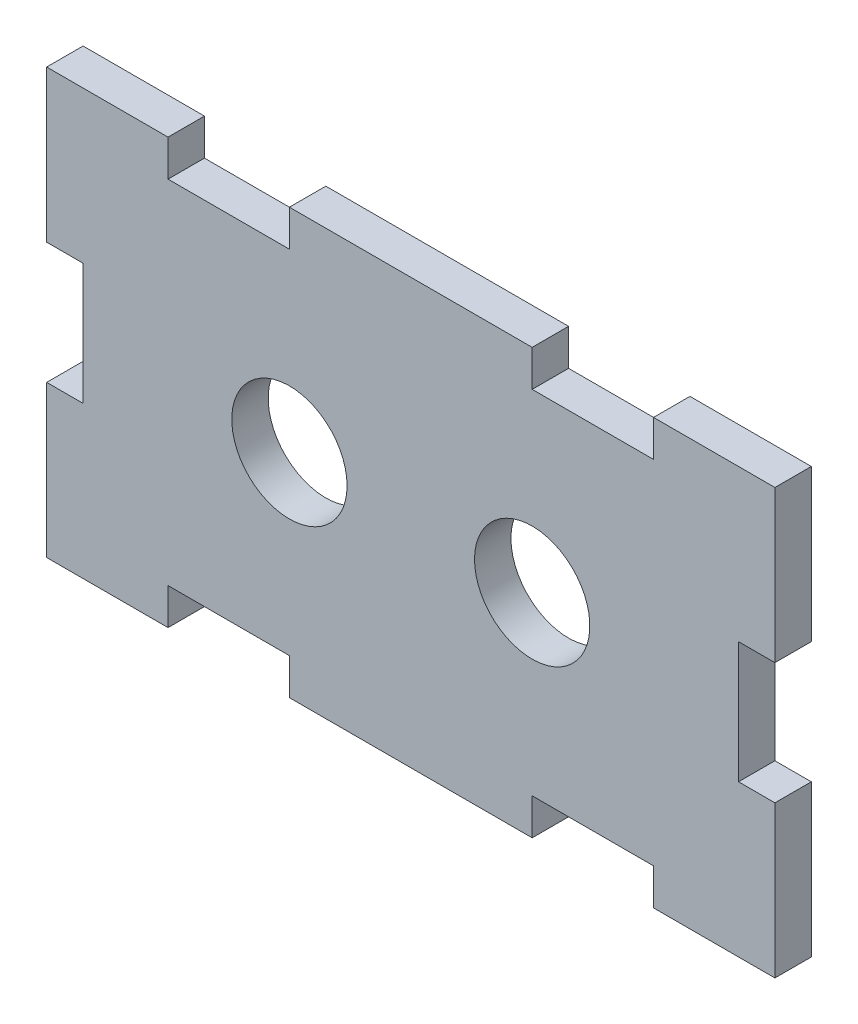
ISO-10303-21;
HEADER;
FILE_DESCRIPTION(('STEP AP214'),'2;1');
FILE_NAME('part.step','',(''),(''),'','','');
FILE_SCHEMA(('AUTOMOTIVE_DESIGN { 1 0 10303 214 1 1 1 1 }'));
ENDSEC;
DATA;
#1=APPLICATION_CONTEXT('core data for automotive mechanical design processes');
#2=APPLICATION_PROTOCOL_DEFINITION('international standard','automotive_design',2000,#1);
#3=PRODUCT_CONTEXT('',#1,'mechanical');
#4=PRODUCT('Part','Part','',(#3));
#5=PRODUCT_RELATED_PRODUCT_CATEGORY('part','',(#4));
#6=PRODUCT_DEFINITION_FORMATION('','',#4);
#7=PRODUCT_DEFINITION_CONTEXT('part definition',#1,'design');
#8=PRODUCT_DEFINITION('design','',#6,#7);
#9=PRODUCT_DEFINITION_SHAPE('','',#8);
#10=(LENGTH_UNIT() NAMED_UNIT(*) SI_UNIT(.MILLI.,.METRE.));
#11=(NAMED_UNIT(*) PLANE_ANGLE_UNIT() SI_UNIT($,.RADIAN.));
#12=(NAMED_UNIT(*) SI_UNIT($,.STERADIAN.) SOLID_ANGLE_UNIT());
#13=UNCERTAINTY_MEASURE_WITH_UNIT(LENGTH_MEASURE(1.E-05),#10,'distance_accuracy_value','');
#14=(GEOMETRIC_REPRESENTATION_CONTEXT(3) GLOBAL_UNCERTAINTY_ASSIGNED_CONTEXT((#13)) GLOBAL_UNIT_ASSIGNED_CONTEXT((#10,
#11,#12)) REPRESENTATION_CONTEXT('',''));
#15=CARTESIAN_POINT('',(0.,0.,0.));
#16=DIRECTION('',(0.,0.,1.));
#17=DIRECTION('',(1.,0.,0.));
#18=AXIS2_PLACEMENT_3D('',#15,#16,#17);
#19=CARTESIAN_POINT('',(0.,0.,3.));
#20=DIRECTION('',(0.,0.,-1.));
#21=DIRECTION('',(-1.,0.,0.));
#22=AXIS2_PLACEMENT_3D('',#19,#20,#21);
#23=PLANE('',#22);
#24=CARTESIAN_POINT('',(10.,0.,3.));
#25=DIRECTION('',(0.,0.,1.));
#26=DIRECTION('',(-1.,0.,0.));
#27=AXIS2_PLACEMENT_3D('',#24,#25,#26);
#28=CIRCLE('',#27,4.75);
#29=CARTESIAN_POINT('',(5.25,0.,3.));
#30=VERTEX_POINT('',#29);
#31=EDGE_CURVE('E381',#30,#30,#28,.T.);
#32=ORIENTED_EDGE('',*,*,#31,.F.);
#33=EDGE_LOOP('',(#32));
#34=FACE_BOUND('',#33,.T.);
#35=CARTESIAN_POINT('',(-10.,0.,3.));
#36=DIRECTION('',(0.,0.,1.));
#37=DIRECTION('',(1.,0.,0.));
#38=AXIS2_PLACEMENT_3D('',#35,#36,#37);
#39=CIRCLE('',#38,4.75);
#40=CARTESIAN_POINT('',(-5.25,0.,3.));
#41=VERTEX_POINT('',#40);
#42=EDGE_CURVE('E387',#41,#41,#39,.T.);
#43=ORIENTED_EDGE('',*,*,#42,.F.);
#44=EDGE_LOOP('',(#43));
#45=FACE_BOUND('',#44,.T.);
#46=DIRECTION('',(-1.,0.,0.));
#47=VECTOR('',#46,1.);
#48=CARTESIAN_POINT('',(30.,-5.,3.));
#49=LINE('',#48,#47);
#50=CARTESIAN_POINT('',(30.,-5.,3.));
#51=VERTEX_POINT('',#50);
#52=CARTESIAN_POINT('',(27.,-5.,3.));
#53=VERTEX_POINT('',#52);
#54=EDGE_CURVE('E249',#51,#53,#49,.T.);
#55=ORIENTED_EDGE('',*,*,#54,.T.);
#56=DIRECTION('',(0.,1.,0.));
#57=VECTOR('',#56,1.);
#58=CARTESIAN_POINT('',(27.,5.,3.));
#59=LINE('',#58,#57);
#60=CARTESIAN_POINT('',(27.,5.,3.));
#61=VERTEX_POINT('',#60);
#62=EDGE_CURVE('E226',#53,#61,#59,.T.);
#63=ORIENTED_EDGE('',*,*,#62,.T.);
#64=DIRECTION('',(1.,0.,0.));
#65=VECTOR('',#64,1.);
#66=CARTESIAN_POINT('',(30.,5.,3.));
#67=LINE('',#66,#65);
#68=CARTESIAN_POINT('',(30.,5.,3.));
#69=VERTEX_POINT('',#68);
#70=EDGE_CURVE('E222',#61,#69,#67,.T.);
#71=ORIENTED_EDGE('',*,*,#70,.T.);
#72=DIRECTION('',(0.,1.,0.));
#73=VECTOR('',#72,1.);
#74=CARTESIAN_POINT('',(30.,-17.5,3.));
#75=LINE('',#74,#73);
#76=CARTESIAN_POINT('',(30.,17.5,3.));
#77=VERTEX_POINT('',#76);
#78=EDGE_CURVE('E401',#69,#77,#75,.T.);
#79=ORIENTED_EDGE('',*,*,#78,.T.);
#80=DIRECTION('',(-1.,0.,0.));
#81=VECTOR('',#80,1.);
#82=CARTESIAN_POINT('',(-30.,17.5,3.));
#83=LINE('',#82,#81);
#84=CARTESIAN_POINT('',(20.,17.5,3.));
#85=VERTEX_POINT('',#84);
#86=EDGE_CURVE('E407',#77,#85,#83,.T.);
#87=ORIENTED_EDGE('',*,*,#86,.T.);
#88=DIRECTION('',(0.,-1.,0.));
#89=VECTOR('',#88,1.);
#90=CARTESIAN_POINT('',(20.,17.5,3.));
#91=LINE('',#90,#89);
#92=CARTESIAN_POINT('',(20.,14.5,3.));
#93=VERTEX_POINT('',#92);
#94=EDGE_CURVE('E338',#85,#93,#91,.T.);
#95=ORIENTED_EDGE('',*,*,#94,.T.);
#96=DIRECTION('',(-1.,0.,0.));
#97=VECTOR('',#96,1.);
#98=CARTESIAN_POINT('',(20.,14.5,3.));
#99=LINE('',#98,#97);
#100=CARTESIAN_POINT('',(10.,14.5,3.));
#101=VERTEX_POINT('',#100);
#102=EDGE_CURVE('E329',#93,#101,#99,.T.);
#103=ORIENTED_EDGE('',*,*,#102,.T.);
#104=DIRECTION('',(0.,1.,0.));
#105=VECTOR('',#104,1.);
#106=CARTESIAN_POINT('',(10.,17.5,3.));
#107=LINE('',#106,#105);
#108=CARTESIAN_POINT('',(10.,17.5,3.));
#109=VERTEX_POINT('',#108);
#110=EDGE_CURVE('E334',#101,#109,#107,.T.);
#111=ORIENTED_EDGE('',*,*,#110,.T.);
#112=CARTESIAN_POINT('',(-10.,17.5,3.));
#113=VERTEX_POINT('',#112);
#114=EDGE_CURVE('E411',#109,#113,#83,.T.);
#115=ORIENTED_EDGE('',*,*,#114,.T.);
#116=DIRECTION('',(0.,1.,0.));
#117=VECTOR('',#116,1.);
#118=CARTESIAN_POINT('',(-10.,17.5,3.));
#119=LINE('',#118,#117);
#120=CARTESIAN_POINT('',(-10.,14.5,3.));
#121=VERTEX_POINT('',#120);
#122=EDGE_CURVE('E354',#121,#113,#119,.T.);
#123=ORIENTED_EDGE('',*,*,#122,.F.);
#124=DIRECTION('',(1.,0.,0.));
#125=VECTOR('',#124,1.);
#126=CARTESIAN_POINT('',(-20.,14.5,3.));
#127=LINE('',#126,#125);
#128=CARTESIAN_POINT('',(-20.,14.5,3.));
#129=VERTEX_POINT('',#128);
#130=EDGE_CURVE('E358',#129,#121,#127,.T.);
#131=ORIENTED_EDGE('',*,*,#130,.F.);
#132=DIRECTION('',(0.,-1.,0.));
#133=VECTOR('',#132,1.);
#134=CARTESIAN_POINT('',(-20.,17.5,3.));
#135=LINE('',#134,#133);
#136=CARTESIAN_POINT('',(-20.,17.5,3.));
#137=VERTEX_POINT('',#136);
#138=EDGE_CURVE('E343',#137,#129,#135,.T.);
#139=ORIENTED_EDGE('',*,*,#138,.F.);
#140=CARTESIAN_POINT('',(-30.,17.5,3.));
#141=VERTEX_POINT('',#140);
#142=EDGE_CURVE('E406',#137,#141,#83,.T.);
#143=ORIENTED_EDGE('',*,*,#142,.T.);
#144=DIRECTION('',(0.,-1.,0.));
#145=VECTOR('',#144,1.);
#146=CARTESIAN_POINT('',(-30.,-17.5,3.));
#147=LINE('',#146,#145);
#148=CARTESIAN_POINT('',(-30.,5.,3.));
#149=VERTEX_POINT('',#148);
#150=EDGE_CURVE('E393',#141,#149,#147,.T.);
#151=ORIENTED_EDGE('',*,*,#150,.T.);
#152=DIRECTION('',(-1.,0.,0.));
#153=VECTOR('',#152,1.);
#154=CARTESIAN_POINT('',(-30.,5.,3.));
#155=LINE('',#154,#153);
#156=CARTESIAN_POINT('',(-27.,5.,3.));
#157=VERTEX_POINT('',#156);
#158=EDGE_CURVE('E58',#157,#149,#155,.T.);
#159=ORIENTED_EDGE('',*,*,#158,.F.);
#160=DIRECTION('',(0.,1.,0.));
#161=VECTOR('',#160,1.);
#162=CARTESIAN_POINT('',(-27.,5.,3.));
#163=LINE('',#162,#161);
#164=CARTESIAN_POINT('',(-27.,-5.,3.));
#165=VERTEX_POINT('',#164);
#166=EDGE_CURVE('E255',#165,#157,#163,.T.);
#167=ORIENTED_EDGE('',*,*,#166,.F.);
#168=DIRECTION('',(1.,0.,0.));
#169=VECTOR('',#168,1.);
#170=CARTESIAN_POINT('',(-30.,-5.,3.));
#171=LINE('',#170,#169);
#172=CARTESIAN_POINT('',(-30.,-5.,3.));
#173=VERTEX_POINT('',#172);
#174=EDGE_CURVE('E235',#173,#165,#171,.T.);
#175=ORIENTED_EDGE('',*,*,#174,.F.);
#176=CARTESIAN_POINT('',(-30.,-17.5,3.));
#177=VERTEX_POINT('',#176);
#178=EDGE_CURVE('E397',#173,#177,#147,.T.);
#179=ORIENTED_EDGE('',*,*,#178,.T.);
#180=DIRECTION('',(1.,0.,0.));
#181=VECTOR('',#180,1.);
#182=CARTESIAN_POINT('',(-30.,-17.5,3.));
#183=LINE('',#182,#181);
#184=CARTESIAN_POINT('',(-20.,-17.5,3.));
#185=VERTEX_POINT('',#184);
#186=EDGE_CURVE('E398',#177,#185,#183,.T.);
#187=ORIENTED_EDGE('',*,*,#186,.T.);
#188=DIRECTION('',(0.,1.,0.));
#189=VECTOR('',#188,1.);
#190=CARTESIAN_POINT('',(-20.,-17.5,3.));
#191=LINE('',#190,#189);
#192=CARTESIAN_POINT('',(-20.,-14.5,3.));
#193=VERTEX_POINT('',#192);
#194=EDGE_CURVE('E286',#185,#193,#191,.T.);
#195=ORIENTED_EDGE('',*,*,#194,.T.);
#196=DIRECTION('',(1.,0.,0.));
#197=VECTOR('',#196,1.);
#198=CARTESIAN_POINT('',(-20.,-14.5,3.));
#199=LINE('',#198,#197);
#200=CARTESIAN_POINT('',(-10.,-14.5,3.));
#201=VERTEX_POINT('',#200);
#202=EDGE_CURVE('E277',#193,#201,#199,.T.);
#203=ORIENTED_EDGE('',*,*,#202,.T.);
#204=DIRECTION('',(0.,-1.,0.));
#205=VECTOR('',#204,1.);
#206=CARTESIAN_POINT('',(-10.,-17.5,3.));
#207=LINE('',#206,#205);
#208=CARTESIAN_POINT('',(-10.,-17.5,3.));
#209=VERTEX_POINT('',#208);
#210=EDGE_CURVE('E282',#201,#209,#207,.T.);
#211=ORIENTED_EDGE('',*,*,#210,.T.);
#212=CARTESIAN_POINT('',(10.,-17.5,3.));
#213=VERTEX_POINT('',#212);
#214=EDGE_CURVE('E402',#209,#213,#183,.T.);
#215=ORIENTED_EDGE('',*,*,#214,.T.);
#216=DIRECTION('',(0.,-1.,0.));
#217=VECTOR('',#216,1.);
#218=CARTESIAN_POINT('',(10.,-17.5,3.));
#219=LINE('',#218,#217);
#220=CARTESIAN_POINT('',(10.,-14.5,3.));
#221=VERTEX_POINT('',#220);
#222=EDGE_CURVE('E302',#221,#213,#219,.T.);
#223=ORIENTED_EDGE('',*,*,#222,.F.);
#224=DIRECTION('',(-1.,0.,0.));
#225=VECTOR('',#224,1.);
#226=CARTESIAN_POINT('',(20.,-14.5,3.));
#227=LINE('',#226,#225);
#228=CARTESIAN_POINT('',(20.,-14.5,3.));
#229=VERTEX_POINT('',#228);
#230=EDGE_CURVE('E306',#229,#221,#227,.T.);
#231=ORIENTED_EDGE('',*,*,#230,.F.);
#232=DIRECTION('',(0.,1.,0.));
#233=VECTOR('',#232,1.);
#234=CARTESIAN_POINT('',(20.,-17.5,3.));
#235=LINE('',#234,#233);
#236=CARTESIAN_POINT('',(20.,-17.5,3.));
#237=VERTEX_POINT('',#236);
#238=EDGE_CURVE('E291',#237,#229,#235,.T.);
#239=ORIENTED_EDGE('',*,*,#238,.F.);
#240=CARTESIAN_POINT('',(30.,-17.5,3.));
#241=VERTEX_POINT('',#240);
#242=EDGE_CURVE('E396',#237,#241,#183,.T.);
#243=ORIENTED_EDGE('',*,*,#242,.T.);
#244=EDGE_CURVE('E403',#241,#51,#75,.T.);
#245=ORIENTED_EDGE('',*,*,#244,.T.);
#246=EDGE_LOOP('',(#55,#63,#71,#79,#87,#95,#103,#111,#115,#123,#131,#139,#143,#151,#159,#167,
#175,#179,#187,#195,#203,#211,#215,#223,#231,#239,#243,#245));
#247=FACE_BOUND('',#246,.T.);
#248=ADVANCED_FACE('F35',(#34,#45,#247),#23,.F.);
#249=CARTESIAN_POINT('',(0.,0.,0.));
#250=DIRECTION('',(0.,0.,-1.));
#251=DIRECTION('',(-1.,0.,0.));
#252=AXIS2_PLACEMENT_3D('',#249,#250,#251);
#253=PLANE('',#252);
#254=CARTESIAN_POINT('',(-10.,0.,0.));
#255=DIRECTION('',(0.,0.,1.));
#256=DIRECTION('',(1.,0.,0.));
#257=AXIS2_PLACEMENT_3D('',#254,#255,#256);
#258=CIRCLE('',#257,4.75);
#259=CARTESIAN_POINT('',(-5.25,0.,0.));
#260=VERTEX_POINT('',#259);
#261=EDGE_CURVE('E384',#260,#260,#258,.T.);
#262=ORIENTED_EDGE('',*,*,#261,.T.);
#263=EDGE_LOOP('',(#262));
#264=FACE_BOUND('',#263,.T.);
#265=CARTESIAN_POINT('',(10.,0.,0.));
#266=DIRECTION('',(0.,0.,1.));
#267=DIRECTION('',(-1.,0.,0.));
#268=AXIS2_PLACEMENT_3D('',#265,#266,#267);
#269=CIRCLE('',#268,4.75);
#270=CARTESIAN_POINT('',(5.25,0.,0.));
#271=VERTEX_POINT('',#270);
#272=EDGE_CURVE('E380',#271,#271,#269,.T.);
#273=ORIENTED_EDGE('',*,*,#272,.T.);
#274=EDGE_LOOP('',(#273));
#275=FACE_BOUND('',#274,.T.);
#276=DIRECTION('',(0.,1.,0.));
#277=VECTOR('',#276,1.);
#278=CARTESIAN_POINT('',(27.,5.,0.));
#279=LINE('',#278,#277);
#280=CARTESIAN_POINT('',(27.,-5.,0.));
#281=VERTEX_POINT('',#280);
#282=CARTESIAN_POINT('',(27.,5.,0.));
#283=VERTEX_POINT('',#282);
#284=EDGE_CURVE('E229',#281,#283,#279,.T.);
#285=ORIENTED_EDGE('',*,*,#284,.F.);
#286=DIRECTION('',(-1.,0.,0.));
#287=VECTOR('',#286,1.);
#288=CARTESIAN_POINT('',(30.,-5.,0.));
#289=LINE('',#288,#287);
#290=CARTESIAN_POINT('',(30.,-5.,0.));
#291=VERTEX_POINT('',#290);
#292=EDGE_CURVE('E236',#291,#281,#289,.T.);
#293=ORIENTED_EDGE('',*,*,#292,.F.);
#294=DIRECTION('',(0.,1.,0.));
#295=VECTOR('',#294,1.);
#296=CARTESIAN_POINT('',(30.,-17.5,0.));
#297=LINE('',#296,#295);
#298=CARTESIAN_POINT('',(30.,-17.5,0.));
#299=VERTEX_POINT('',#298);
#300=EDGE_CURVE('E420',#299,#291,#297,.T.);
#301=ORIENTED_EDGE('',*,*,#300,.F.);
#302=DIRECTION('',(1.,0.,0.));
#303=VECTOR('',#302,1.);
#304=CARTESIAN_POINT('',(-30.,-17.5,0.));
#305=LINE('',#304,#303);
#306=CARTESIAN_POINT('',(20.,-17.5,0.));
#307=VERTEX_POINT('',#306);
#308=EDGE_CURVE('E415',#307,#299,#305,.T.);
#309=ORIENTED_EDGE('',*,*,#308,.F.);
#310=DIRECTION('',(0.,1.,0.));
#311=VECTOR('',#310,1.);
#312=CARTESIAN_POINT('',(20.,-17.5,0.));
#313=LINE('',#312,#311);
#314=CARTESIAN_POINT('',(20.,-14.5,0.));
#315=VERTEX_POINT('',#314);
#316=EDGE_CURVE('E314',#307,#315,#313,.T.);
#317=ORIENTED_EDGE('',*,*,#316,.T.);
#318=DIRECTION('',(-1.,0.,0.));
#319=VECTOR('',#318,1.);
#320=CARTESIAN_POINT('',(20.,-14.5,0.));
#321=LINE('',#320,#319);
#322=CARTESIAN_POINT('',(10.,-14.5,0.));
#323=VERTEX_POINT('',#322);
#324=EDGE_CURVE('E305',#315,#323,#321,.T.);
#325=ORIENTED_EDGE('',*,*,#324,.T.);
#326=DIRECTION('',(0.,-1.,0.));
#327=VECTOR('',#326,1.);
#328=CARTESIAN_POINT('',(10.,-17.5,0.));
#329=LINE('',#328,#327);
#330=CARTESIAN_POINT('',(10.,-17.5,0.));
#331=VERTEX_POINT('',#330);
#332=EDGE_CURVE('E319',#323,#331,#329,.T.);
#333=ORIENTED_EDGE('',*,*,#332,.T.);
#334=CARTESIAN_POINT('',(-10.,-17.5,0.));
#335=VERTEX_POINT('',#334);
#336=EDGE_CURVE('E419',#335,#331,#305,.T.);
#337=ORIENTED_EDGE('',*,*,#336,.F.);
#338=DIRECTION('',(0.,-1.,0.));
#339=VECTOR('',#338,1.);
#340=CARTESIAN_POINT('',(-10.,-17.5,0.));
#341=LINE('',#340,#339);
#342=CARTESIAN_POINT('',(-10.,-14.5,0.));
#343=VERTEX_POINT('',#342);
#344=EDGE_CURVE('E289',#343,#335,#341,.T.);
#345=ORIENTED_EDGE('',*,*,#344,.F.);
#346=DIRECTION('',(1.,0.,0.));
#347=VECTOR('',#346,1.);
#348=CARTESIAN_POINT('',(-20.,-14.5,0.));
#349=LINE('',#348,#347);
#350=CARTESIAN_POINT('',(-20.,-14.5,0.));
#351=VERTEX_POINT('',#350);
#352=EDGE_CURVE('E292',#351,#343,#349,.T.);
#353=ORIENTED_EDGE('',*,*,#352,.F.);
#354=DIRECTION('',(0.,1.,0.));
#355=VECTOR('',#354,1.);
#356=CARTESIAN_POINT('',(-20.,-17.5,0.));
#357=LINE('',#356,#355);
#358=CARTESIAN_POINT('',(-20.,-17.5,0.));
#359=VERTEX_POINT('',#358);
#360=EDGE_CURVE('E294',#359,#351,#357,.T.);
#361=ORIENTED_EDGE('',*,*,#360,.F.);
#362=CARTESIAN_POINT('',(-30.,-17.5,0.));
#363=VERTEX_POINT('',#362);
#364=EDGE_CURVE('E416',#363,#359,#305,.T.);
#365=ORIENTED_EDGE('',*,*,#364,.F.);
#366=DIRECTION('',(0.,-1.,0.));
#367=VECTOR('',#366,1.);
#368=CARTESIAN_POINT('',(-30.,-17.5,0.));
#369=LINE('',#368,#367);
#370=CARTESIAN_POINT('',(-30.,-5.,0.));
#371=VERTEX_POINT('',#370);
#372=EDGE_CURVE('E390',#371,#363,#369,.T.);
#373=ORIENTED_EDGE('',*,*,#372,.F.);
#374=DIRECTION('',(1.,0.,0.));
#375=VECTOR('',#374,1.);
#376=CARTESIAN_POINT('',(-30.,-5.,0.));
#377=LINE('',#376,#375);
#378=CARTESIAN_POINT('',(-27.,-5.,0.));
#379=VERTEX_POINT('',#378);
#380=EDGE_CURVE('E254',#371,#379,#377,.T.);
#381=ORIENTED_EDGE('',*,*,#380,.T.);
#382=DIRECTION('',(0.,1.,0.));
#383=VECTOR('',#382,1.);
#384=CARTESIAN_POINT('',(-27.,5.,0.));
#385=LINE('',#384,#383);
#386=CARTESIAN_POINT('',(-27.,5.,0.));
#387=VERTEX_POINT('',#386);
#388=EDGE_CURVE('E268',#379,#387,#385,.T.);
#389=ORIENTED_EDGE('',*,*,#388,.T.);
#390=DIRECTION('',(-1.,0.,0.));
#391=VECTOR('',#390,1.);
#392=CARTESIAN_POINT('',(-30.,5.,0.));
#393=LINE('',#392,#391);
#394=CARTESIAN_POINT('',(-30.,5.,0.));
#395=VERTEX_POINT('',#394);
#396=EDGE_CURVE('E263',#387,#395,#393,.T.);
#397=ORIENTED_EDGE('',*,*,#396,.T.);
#398=CARTESIAN_POINT('',(-30.,17.5,0.));
#399=VERTEX_POINT('',#398);
#400=EDGE_CURVE('E412',#399,#395,#369,.T.);
#401=ORIENTED_EDGE('',*,*,#400,.F.);
#402=DIRECTION('',(-1.,0.,0.));
#403=VECTOR('',#402,1.);
#404=CARTESIAN_POINT('',(-30.,17.5,0.));
#405=LINE('',#404,#403);
#406=CARTESIAN_POINT('',(-20.,17.5,0.));
#407=VERTEX_POINT('',#406);
#408=EDGE_CURVE('E423',#407,#399,#405,.T.);
#409=ORIENTED_EDGE('',*,*,#408,.F.);
#410=DIRECTION('',(0.,-1.,0.));
#411=VECTOR('',#410,1.);
#412=CARTESIAN_POINT('',(-20.,17.5,0.));
#413=LINE('',#412,#411);
#414=CARTESIAN_POINT('',(-20.,14.5,0.));
#415=VERTEX_POINT('',#414);
#416=EDGE_CURVE('E366',#407,#415,#413,.T.);
#417=ORIENTED_EDGE('',*,*,#416,.T.);
#418=DIRECTION('',(1.,0.,0.));
#419=VECTOR('',#418,1.);
#420=CARTESIAN_POINT('',(-20.,14.5,0.));
#421=LINE('',#420,#419);
#422=CARTESIAN_POINT('',(-10.,14.5,0.));
#423=VERTEX_POINT('',#422);
#424=EDGE_CURVE('E357',#415,#423,#421,.T.);
#425=ORIENTED_EDGE('',*,*,#424,.T.);
#426=DIRECTION('',(0.,1.,0.));
#427=VECTOR('',#426,1.);
#428=CARTESIAN_POINT('',(-10.,17.5,0.));
#429=LINE('',#428,#427);
#430=CARTESIAN_POINT('',(-10.,17.5,0.));
#431=VERTEX_POINT('',#430);
#432=EDGE_CURVE('E371',#423,#431,#429,.T.);
#433=ORIENTED_EDGE('',*,*,#432,.T.);
#434=CARTESIAN_POINT('',(10.,17.5,0.));
#435=VERTEX_POINT('',#434);
#436=EDGE_CURVE('E427',#435,#431,#405,.T.);
#437=ORIENTED_EDGE('',*,*,#436,.F.);
#438=DIRECTION('',(0.,1.,0.));
#439=VECTOR('',#438,1.);
#440=CARTESIAN_POINT('',(10.,17.5,0.));
#441=LINE('',#440,#439);
#442=CARTESIAN_POINT('',(10.,14.5,0.));
#443=VERTEX_POINT('',#442);
#444=EDGE_CURVE('E341',#443,#435,#441,.T.);
#445=ORIENTED_EDGE('',*,*,#444,.F.);
#446=DIRECTION('',(-1.,0.,0.));
#447=VECTOR('',#446,1.);
#448=CARTESIAN_POINT('',(20.,14.5,0.));
#449=LINE('',#448,#447);
#450=CARTESIAN_POINT('',(20.,14.5,0.));
#451=VERTEX_POINT('',#450);
#452=EDGE_CURVE('E344',#451,#443,#449,.T.);
#453=ORIENTED_EDGE('',*,*,#452,.F.);
#454=DIRECTION('',(0.,-1.,0.));
#455=VECTOR('',#454,1.);
#456=CARTESIAN_POINT('',(20.,17.5,0.));
#457=LINE('',#456,#455);
#458=CARTESIAN_POINT('',(20.,17.5,0.));
#459=VERTEX_POINT('',#458);
#460=EDGE_CURVE('E346',#459,#451,#457,.T.);
#461=ORIENTED_EDGE('',*,*,#460,.F.);
#462=CARTESIAN_POINT('',(30.,17.5,0.));
#463=VERTEX_POINT('',#462);
#464=EDGE_CURVE('E424',#463,#459,#405,.T.);
#465=ORIENTED_EDGE('',*,*,#464,.F.);
#466=CARTESIAN_POINT('',(30.,5.,0.));
#467=VERTEX_POINT('',#466);
#468=EDGE_CURVE('E241',#467,#463,#297,.T.);
#469=ORIENTED_EDGE('',*,*,#468,.F.);
#470=DIRECTION('',(1.,0.,0.));
#471=VECTOR('',#470,1.);
#472=CARTESIAN_POINT('',(30.,5.,0.));
#473=LINE('',#472,#471);
#474=EDGE_CURVE('E50',#283,#467,#473,.T.);
#475=ORIENTED_EDGE('',*,*,#474,.F.);
#476=EDGE_LOOP('',(#285,#293,#301,#309,#317,#325,#333,#337,#345,#353,#361,#365,#373,#381,#389,
#397,#401,#409,#417,#425,#433,#437,#445,#453,#461,#465,#469,#475));
#477=FACE_BOUND('',#476,.T.);
#478=ADVANCED_FACE('F239',(#264,#275,#477),#253,.T.);
#479=CARTESIAN_POINT('',(30.,-17.5,3.));
#480=DIRECTION('',(-1.,0.,0.));
#481=DIRECTION('',(0.,0.,1.));
#482=AXIS2_PLACEMENT_3D('',#479,#480,#481);
#483=PLANE('',#482);
#484=DIRECTION('',(0.,0.,1.));
#485=VECTOR('',#484,1.);
#486=CARTESIAN_POINT('',(30.,-5.,-10.4403065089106));
#487=LINE('',#486,#485);
#488=EDGE_CURVE('E246',#291,#51,#487,.T.);
#489=ORIENTED_EDGE('',*,*,#488,.T.);
#490=ORIENTED_EDGE('',*,*,#244,.F.);
#491=DIRECTION('',(0.,0.,-1.));
#492=VECTOR('',#491,1.);
#493=CARTESIAN_POINT('',(30.,-17.5,3.));
#494=LINE('',#493,#492);
#495=EDGE_CURVE('E43',#241,#299,#494,.T.);
#496=ORIENTED_EDGE('',*,*,#495,.T.);
#497=ORIENTED_EDGE('',*,*,#300,.T.);
#498=EDGE_LOOP('',(#489,#490,#496,#497));
#499=FACE_BOUND('',#498,.T.);
#500=ADVANCED_FACE('F437',(#499),#483,.F.);
#501=DIRECTION('',(0.,0.,1.));
#502=VECTOR('',#501,1.);
#503=CARTESIAN_POINT('',(30.,5.,-10.4403065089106));
#504=LINE('',#503,#502);
#505=EDGE_CURVE('E250',#467,#69,#504,.T.);
#506=ORIENTED_EDGE('',*,*,#505,.F.);
#507=ORIENTED_EDGE('',*,*,#468,.T.);
#508=DIRECTION('',(0.,0.,-1.));
#509=VECTOR('',#508,1.);
#510=CARTESIAN_POINT('',(30.,17.5,3.));
#511=LINE('',#510,#509);
#512=EDGE_CURVE('E430',#77,#463,#511,.T.);
#513=ORIENTED_EDGE('',*,*,#512,.F.);
#514=ORIENTED_EDGE('',*,*,#78,.F.);
#515=EDGE_LOOP('',(#506,#507,#513,#514));
#516=FACE_BOUND('',#515,.T.);
#517=ADVANCED_FACE('F498',(#516),#483,.F.);
#518=CARTESIAN_POINT('',(-30.,-17.5,3.));
#519=DIRECTION('',(1.,0.,0.));
#520=DIRECTION('',(0.,0.,-1.));
#521=AXIS2_PLACEMENT_3D('',#518,#519,#520);
#522=PLANE('',#521);
#523=ORIENTED_EDGE('',*,*,#178,.F.);
#524=DIRECTION('',(0.,0.,1.));
#525=VECTOR('',#524,1.);
#526=CARTESIAN_POINT('',(-30.,-5.,-10.4403065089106));
#527=LINE('',#526,#525);
#528=EDGE_CURVE('E272',#371,#173,#527,.T.);
#529=ORIENTED_EDGE('',*,*,#528,.F.);
#530=ORIENTED_EDGE('',*,*,#372,.T.);
#531=DIRECTION('',(0.,0.,-1.));
#532=VECTOR('',#531,1.);
#533=CARTESIAN_POINT('',(-30.,-17.5,3.));
#534=LINE('',#533,#532);
#535=EDGE_CURVE('E11',#177,#363,#534,.T.);
#536=ORIENTED_EDGE('',*,*,#535,.F.);
#537=EDGE_LOOP('',(#523,#529,#530,#536));
#538=FACE_BOUND('',#537,.T.);
#539=ADVANCED_FACE('F505',(#538),#522,.F.);
#540=CARTESIAN_POINT('',(-30.,-17.5,3.));
#541=DIRECTION('',(0.,1.,0.));
#542=DIRECTION('',(0.,0.,1.));
#543=AXIS2_PLACEMENT_3D('',#540,#541,#542);
#544=PLANE('',#543);
#545=DIRECTION('',(0.,0.,1.));
#546=VECTOR('',#545,1.);
#547=CARTESIAN_POINT('',(-20.,-17.5,-10.4403065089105));
#548=LINE('',#547,#546);
#549=EDGE_CURVE('E276',#359,#185,#548,.T.);
#550=ORIENTED_EDGE('',*,*,#549,.T.);
#551=ORIENTED_EDGE('',*,*,#186,.F.);
#552=ORIENTED_EDGE('',*,*,#535,.T.);
#553=ORIENTED_EDGE('',*,*,#364,.T.);
#554=EDGE_LOOP('',(#550,#551,#552,#553));
#555=FACE_BOUND('',#554,.T.);
#556=ADVANCED_FACE('F500',(#555),#544,.F.);
#557=DIRECTION('',(0.,0.,1.));
#558=VECTOR('',#557,1.);
#559=CARTESIAN_POINT('',(-10.,-17.5,-10.4403065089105));
#560=LINE('',#559,#558);
#561=EDGE_CURVE('E285',#335,#209,#560,.T.);
#562=ORIENTED_EDGE('',*,*,#561,.F.);
#563=ORIENTED_EDGE('',*,*,#336,.T.);
#564=DIRECTION('',(0.,0.,1.));
#565=VECTOR('',#564,1.);
#566=CARTESIAN_POINT('',(10.,-17.5,-10.4403065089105));
#567=LINE('',#566,#565);
#568=EDGE_CURVE('E322',#331,#213,#567,.T.);
#569=ORIENTED_EDGE('',*,*,#568,.T.);
#570=ORIENTED_EDGE('',*,*,#214,.F.);
#571=EDGE_LOOP('',(#562,#563,#569,#570));
#572=FACE_BOUND('',#571,.T.);
#573=ADVANCED_FACE('F457',(#572),#544,.F.);
#574=CARTESIAN_POINT('',(-30.,17.5,3.));
#575=DIRECTION('',(0.,-1.,0.));
#576=DIRECTION('',(0.,0.,-1.));
#577=AXIS2_PLACEMENT_3D('',#574,#575,#576);
#578=PLANE('',#577);
#579=DIRECTION('',(0.,0.,1.));
#580=VECTOR('',#579,1.);
#581=CARTESIAN_POINT('',(20.,17.5,-10.4403065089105));
#582=LINE('',#581,#580);
#583=EDGE_CURVE('E328',#459,#85,#582,.T.);
#584=ORIENTED_EDGE('',*,*,#583,.T.);
#585=ORIENTED_EDGE('',*,*,#86,.F.);
#586=ORIENTED_EDGE('',*,*,#512,.T.);
#587=ORIENTED_EDGE('',*,*,#464,.T.);
#588=EDGE_LOOP('',(#584,#585,#586,#587));
#589=FACE_BOUND('',#588,.T.);
#590=ADVANCED_FACE('F495',(#589),#578,.F.);
#591=DIRECTION('',(0.,0.,1.));
#592=VECTOR('',#591,1.);
#593=CARTESIAN_POINT('',(10.,17.5,-10.4403065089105));
#594=LINE('',#593,#592);
#595=EDGE_CURVE('E337',#435,#109,#594,.T.);
#596=ORIENTED_EDGE('',*,*,#595,.F.);
#597=ORIENTED_EDGE('',*,*,#436,.T.);
#598=DIRECTION('',(0.,0.,1.));
#599=VECTOR('',#598,1.);
#600=CARTESIAN_POINT('',(-10.,17.5,-10.4403065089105));
#601=LINE('',#600,#599);
#602=EDGE_CURVE('E374',#431,#113,#601,.T.);
#603=ORIENTED_EDGE('',*,*,#602,.T.);
#604=ORIENTED_EDGE('',*,*,#114,.F.);
#605=EDGE_LOOP('',(#596,#597,#603,#604));
#606=FACE_BOUND('',#605,.T.);
#607=ADVANCED_FACE('F496',(#606),#578,.F.);
#608=ORIENTED_EDGE('',*,*,#400,.T.);
#609=DIRECTION('',(0.,0.,1.));
#610=VECTOR('',#609,1.);
#611=CARTESIAN_POINT('',(-30.,5.,-10.4403065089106));
#612=LINE('',#611,#610);
#613=EDGE_CURVE('E266',#395,#149,#612,.T.);
#614=ORIENTED_EDGE('',*,*,#613,.T.);
#615=ORIENTED_EDGE('',*,*,#150,.F.);
#616=DIRECTION('',(0.,0.,-1.));
#617=VECTOR('',#616,1.);
#618=CARTESIAN_POINT('',(-30.,17.5,3.));
#619=LINE('',#618,#617);
#620=EDGE_CURVE('E410',#141,#399,#619,.T.);
#621=ORIENTED_EDGE('',*,*,#620,.T.);
#622=EDGE_LOOP('',(#608,#614,#615,#621));
#623=FACE_BOUND('',#622,.T.);
#624=ADVANCED_FACE('F37',(#623),#522,.F.);
#625=ORIENTED_EDGE('',*,*,#242,.F.);
#626=DIRECTION('',(0.,0.,1.));
#627=VECTOR('',#626,1.);
#628=CARTESIAN_POINT('',(20.,-17.5,-10.4403065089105));
#629=LINE('',#628,#627);
#630=EDGE_CURVE('E318',#307,#237,#629,.T.);
#631=ORIENTED_EDGE('',*,*,#630,.F.);
#632=ORIENTED_EDGE('',*,*,#308,.T.);
#633=ORIENTED_EDGE('',*,*,#495,.F.);
#634=EDGE_LOOP('',(#625,#631,#632,#633));
#635=FACE_BOUND('',#634,.T.);
#636=ADVANCED_FACE('F460',(#635),#544,.F.);
#637=ORIENTED_EDGE('',*,*,#142,.F.);
#638=DIRECTION('',(0.,0.,1.));
#639=VECTOR('',#638,1.);
#640=CARTESIAN_POINT('',(-20.,17.5,-10.4403065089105));
#641=LINE('',#640,#639);
#642=EDGE_CURVE('E370',#407,#137,#641,.T.);
#643=ORIENTED_EDGE('',*,*,#642,.F.);
#644=ORIENTED_EDGE('',*,*,#408,.T.);
#645=ORIENTED_EDGE('',*,*,#620,.F.);
#646=EDGE_LOOP('',(#637,#643,#644,#645));
#647=FACE_BOUND('',#646,.T.);
#648=ADVANCED_FACE('F491',(#647),#578,.F.);
#649=CARTESIAN_POINT('',(-10.,0.,3.));
#650=DIRECTION('',(0.,0.,-1.));
#651=DIRECTION('',(-1.,0.,0.));
#652=AXIS2_PLACEMENT_3D('',#649,#650,#651);
#653=CYLINDRICAL_SURFACE('',#652,4.75);
#654=ORIENTED_EDGE('',*,*,#42,.T.);
#655=EDGE_LOOP('',(#654));
#656=FACE_BOUND('',#655,.T.);
#657=ORIENTED_EDGE('',*,*,#261,.F.);
#658=EDGE_LOOP('',(#657));
#659=FACE_BOUND('',#658,.T.);
#660=ADVANCED_FACE('F488',(#656,#659),#653,.F.);
#661=CARTESIAN_POINT('',(10.,0.,3.));
#662=DIRECTION('',(0.,0.,-1.));
#663=DIRECTION('',(-1.,0.,0.));
#664=AXIS2_PLACEMENT_3D('',#661,#662,#663);
#665=CYLINDRICAL_SURFACE('',#664,4.75);
#666=ORIENTED_EDGE('',*,*,#31,.T.);
#667=EDGE_LOOP('',(#666));
#668=FACE_BOUND('',#667,.T.);
#669=ORIENTED_EDGE('',*,*,#272,.F.);
#670=EDGE_LOOP('',(#669));
#671=FACE_BOUND('',#670,.T.);
#672=ADVANCED_FACE('F756',(#668,#671),#665,.F.);
#673=CARTESIAN_POINT('',(-20.,14.5,-10.4403065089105));
#674=DIRECTION('',(0.,-1.,0.));
#675=DIRECTION('',(1.,0.,0.));
#676=AXIS2_PLACEMENT_3D('',#673,#674,#675);
#677=PLANE('',#676);
#678=DIRECTION('',(0.,0.,1.));
#679=VECTOR('',#678,1.);
#680=CARTESIAN_POINT('',(-20.,14.5,-10.4403065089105));
#681=LINE('',#680,#679);
#682=EDGE_CURVE('E369',#415,#129,#681,.T.);
#683=ORIENTED_EDGE('',*,*,#682,.T.);
#684=ORIENTED_EDGE('',*,*,#130,.T.);
#685=DIRECTION('',(0.,0.,1.));
#686=VECTOR('',#685,1.);
#687=CARTESIAN_POINT('',(-10.,14.5,-10.4403065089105));
#688=LINE('',#687,#686);
#689=EDGE_CURVE('E365',#423,#121,#688,.T.);
#690=ORIENTED_EDGE('',*,*,#689,.F.);
#691=ORIENTED_EDGE('',*,*,#424,.F.);
#692=EDGE_LOOP('',(#683,#684,#690,#691));
#693=FACE_BOUND('',#692,.T.);
#694=ADVANCED_FACE('F763',(#693),#677,.F.);
#695=CARTESIAN_POINT('',(-10.,17.5,-10.4403065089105));
#696=DIRECTION('',(1.,0.,0.));
#697=DIRECTION('',(0.,0.,-1.));
#698=AXIS2_PLACEMENT_3D('',#695,#696,#697);
#699=PLANE('',#698);
#700=ORIENTED_EDGE('',*,*,#689,.T.);
#701=ORIENTED_EDGE('',*,*,#122,.T.);
#702=ORIENTED_EDGE('',*,*,#602,.F.);
#703=ORIENTED_EDGE('',*,*,#432,.F.);
#704=EDGE_LOOP('',(#700,#701,#702,#703));
#705=FACE_BOUND('',#704,.T.);
#706=ADVANCED_FACE('F770',(#705),#699,.F.);
#707=CARTESIAN_POINT('',(-20.,17.5,-10.4403065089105));
#708=DIRECTION('',(-1.,0.,0.));
#709=DIRECTION('',(0.,0.,1.));
#710=AXIS2_PLACEMENT_3D('',#707,#708,#709);
#711=PLANE('',#710);
#712=ORIENTED_EDGE('',*,*,#642,.T.);
#713=ORIENTED_EDGE('',*,*,#138,.T.);
#714=ORIENTED_EDGE('',*,*,#682,.F.);
#715=ORIENTED_EDGE('',*,*,#416,.F.);
#716=EDGE_LOOP('',(#712,#713,#714,#715));
#717=FACE_BOUND('',#716,.T.);
#718=ADVANCED_FACE('F699',(#717),#711,.F.);
#719=CARTESIAN_POINT('',(20.,17.5,-10.4403065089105));
#720=DIRECTION('',(-1.,0.,0.));
#721=DIRECTION('',(0.,0.,1.));
#722=AXIS2_PLACEMENT_3D('',#719,#720,#721);
#723=PLANE('',#722);
#724=ORIENTED_EDGE('',*,*,#460,.T.);
#725=DIRECTION('',(0.,0.,1.));
#726=VECTOR('',#725,1.);
#727=CARTESIAN_POINT('',(20.,14.5,-10.4403065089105));
#728=LINE('',#727,#726);
#729=EDGE_CURVE('E333',#451,#93,#728,.T.);
#730=ORIENTED_EDGE('',*,*,#729,.T.);
#731=ORIENTED_EDGE('',*,*,#94,.F.);
#732=ORIENTED_EDGE('',*,*,#583,.F.);
#733=EDGE_LOOP('',(#724,#730,#731,#732));
#734=FACE_BOUND('',#733,.T.);
#735=ADVANCED_FACE('F525',(#734),#723,.T.);
#736=CARTESIAN_POINT('',(20.,14.5,-10.4403065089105));
#737=DIRECTION('',(0.,1.,0.));
#738=DIRECTION('',(-1.,0.,0.));
#739=AXIS2_PLACEMENT_3D('',#736,#737,#738);
#740=PLANE('',#739);
#741=ORIENTED_EDGE('',*,*,#452,.T.);
#742=DIRECTION('',(0.,0.,1.));
#743=VECTOR('',#742,1.);
#744=CARTESIAN_POINT('',(10.,14.5,-10.4403065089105));
#745=LINE('',#744,#743);
#746=EDGE_CURVE('E332',#443,#101,#745,.T.);
#747=ORIENTED_EDGE('',*,*,#746,.T.);
#748=ORIENTED_EDGE('',*,*,#102,.F.);
#749=ORIENTED_EDGE('',*,*,#729,.F.);
#750=EDGE_LOOP('',(#741,#747,#748,#749));
#751=FACE_BOUND('',#750,.T.);
#752=ADVANCED_FACE('F474',(#751),#740,.T.);
#753=CARTESIAN_POINT('',(10.,17.5,-10.4403065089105));
#754=DIRECTION('',(1.,0.,0.));
#755=DIRECTION('',(0.,0.,-1.));
#756=AXIS2_PLACEMENT_3D('',#753,#754,#755);
#757=PLANE('',#756);
#758=ORIENTED_EDGE('',*,*,#444,.T.);
#759=ORIENTED_EDGE('',*,*,#595,.T.);
#760=ORIENTED_EDGE('',*,*,#110,.F.);
#761=ORIENTED_EDGE('',*,*,#746,.F.);
#762=EDGE_LOOP('',(#758,#759,#760,#761));
#763=FACE_BOUND('',#762,.T.);
#764=ADVANCED_FACE('F467',(#763),#757,.T.);
#765=CARTESIAN_POINT('',(20.,-14.5,-10.4403065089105));
#766=DIRECTION('',(0.,1.,0.));
#767=DIRECTION('',(-1.,0.,0.));
#768=AXIS2_PLACEMENT_3D('',#765,#766,#767);
#769=PLANE('',#768);
#770=DIRECTION('',(0.,0.,1.));
#771=VECTOR('',#770,1.);
#772=CARTESIAN_POINT('',(20.,-14.5,-10.4403065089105));
#773=LINE('',#772,#771);
#774=EDGE_CURVE('E317',#315,#229,#773,.T.);
#775=ORIENTED_EDGE('',*,*,#774,.T.);
#776=ORIENTED_EDGE('',*,*,#230,.T.);
#777=DIRECTION('',(0.,0.,1.));
#778=VECTOR('',#777,1.);
#779=CARTESIAN_POINT('',(10.,-14.5,-10.4403065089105));
#780=LINE('',#779,#778);
#781=EDGE_CURVE('E313',#323,#221,#780,.T.);
#782=ORIENTED_EDGE('',*,*,#781,.F.);
#783=ORIENTED_EDGE('',*,*,#324,.F.);
#784=EDGE_LOOP('',(#775,#776,#782,#783));
#785=FACE_BOUND('',#784,.T.);
#786=ADVANCED_FACE('F465',(#785),#769,.F.);
#787=CARTESIAN_POINT('',(10.,-17.5,-10.4403065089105));
#788=DIRECTION('',(-1.,0.,0.));
#789=DIRECTION('',(0.,0.,1.));
#790=AXIS2_PLACEMENT_3D('',#787,#788,#789);
#791=PLANE('',#790);
#792=ORIENTED_EDGE('',*,*,#781,.T.);
#793=ORIENTED_EDGE('',*,*,#222,.T.);
#794=ORIENTED_EDGE('',*,*,#568,.F.);
#795=ORIENTED_EDGE('',*,*,#332,.F.);
#796=EDGE_LOOP('',(#792,#793,#794,#795));
#797=FACE_BOUND('',#796,.T.);
#798=ADVANCED_FACE('F455',(#797),#791,.F.);
#799=CARTESIAN_POINT('',(20.,-17.5,-10.4403065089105));
#800=DIRECTION('',(1.,0.,0.));
#801=DIRECTION('',(0.,0.,-1.));
#802=AXIS2_PLACEMENT_3D('',#799,#800,#801);
#803=PLANE('',#802);
#804=ORIENTED_EDGE('',*,*,#630,.T.);
#805=ORIENTED_EDGE('',*,*,#238,.T.);
#806=ORIENTED_EDGE('',*,*,#774,.F.);
#807=ORIENTED_EDGE('',*,*,#316,.F.);
#808=EDGE_LOOP('',(#804,#805,#806,#807));
#809=FACE_BOUND('',#808,.T.);
#810=ADVANCED_FACE('F462',(#809),#803,.F.);
#811=CARTESIAN_POINT('',(-20.,-17.5,-10.4403065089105));
#812=DIRECTION('',(1.,0.,0.));
#813=DIRECTION('',(0.,0.,-1.));
#814=AXIS2_PLACEMENT_3D('',#811,#812,#813);
#815=PLANE('',#814);
#816=ORIENTED_EDGE('',*,*,#360,.T.);
#817=DIRECTION('',(0.,0.,1.));
#818=VECTOR('',#817,1.);
#819=CARTESIAN_POINT('',(-20.,-14.5,-10.4403065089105));
#820=LINE('',#819,#818);
#821=EDGE_CURVE('E281',#351,#193,#820,.T.);
#822=ORIENTED_EDGE('',*,*,#821,.T.);
#823=ORIENTED_EDGE('',*,*,#194,.F.);
#824=ORIENTED_EDGE('',*,*,#549,.F.);
#825=EDGE_LOOP('',(#816,#822,#823,#824));
#826=FACE_BOUND('',#825,.T.);
#827=ADVANCED_FACE('F561',(#826),#815,.T.);
#828=CARTESIAN_POINT('',(-20.,-14.5,-10.4403065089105));
#829=DIRECTION('',(0.,-1.,0.));
#830=DIRECTION('',(1.,0.,0.));
#831=AXIS2_PLACEMENT_3D('',#828,#829,#830);
#832=PLANE('',#831);
#833=ORIENTED_EDGE('',*,*,#352,.T.);
#834=DIRECTION('',(0.,0.,1.));
#835=VECTOR('',#834,1.);
#836=CARTESIAN_POINT('',(-10.,-14.5,-10.4403065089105));
#837=LINE('',#836,#835);
#838=EDGE_CURVE('E280',#343,#201,#837,.T.);
#839=ORIENTED_EDGE('',*,*,#838,.T.);
#840=ORIENTED_EDGE('',*,*,#202,.F.);
#841=ORIENTED_EDGE('',*,*,#821,.F.);
#842=EDGE_LOOP('',(#833,#839,#840,#841));
#843=FACE_BOUND('',#842,.T.);
#844=ADVANCED_FACE('F565',(#843),#832,.T.);
#845=CARTESIAN_POINT('',(-10.,-17.5,-10.4403065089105));
#846=DIRECTION('',(-1.,0.,0.));
#847=DIRECTION('',(0.,0.,1.));
#848=AXIS2_PLACEMENT_3D('',#845,#846,#847);
#849=PLANE('',#848);
#850=ORIENTED_EDGE('',*,*,#344,.T.);
#851=ORIENTED_EDGE('',*,*,#561,.T.);
#852=ORIENTED_EDGE('',*,*,#210,.F.);
#853=ORIENTED_EDGE('',*,*,#838,.F.);
#854=EDGE_LOOP('',(#850,#851,#852,#853));
#855=FACE_BOUND('',#854,.T.);
#856=ADVANCED_FACE('F568',(#855),#849,.T.);
#857=CARTESIAN_POINT('',(-30.,-5.,-10.4403065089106));
#858=DIRECTION('',(0.,-1.,0.));
#859=DIRECTION('',(1.,0.,0.));
#860=AXIS2_PLACEMENT_3D('',#857,#858,#859);
#861=PLANE('',#860);
#862=ORIENTED_EDGE('',*,*,#528,.T.);
#863=ORIENTED_EDGE('',*,*,#174,.T.);
#864=DIRECTION('',(0.,0.,1.));
#865=VECTOR('',#864,1.);
#866=CARTESIAN_POINT('',(-27.,-5.,-10.4403065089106));
#867=LINE('',#866,#865);
#868=EDGE_CURVE('E262',#379,#165,#867,.T.);
#869=ORIENTED_EDGE('',*,*,#868,.F.);
#870=ORIENTED_EDGE('',*,*,#380,.F.);
#871=EDGE_LOOP('',(#862,#863,#869,#870));
#872=FACE_BOUND('',#871,.T.);
#873=ADVANCED_FACE('F550',(#872),#861,.F.);
#874=CARTESIAN_POINT('',(-27.,5.,-10.4403065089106));
#875=DIRECTION('',(1.,0.,0.));
#876=DIRECTION('',(0.,1.,0.));
#877=AXIS2_PLACEMENT_3D('',#874,#875,#876);
#878=PLANE('',#877);
#879=ORIENTED_EDGE('',*,*,#868,.T.);
#880=ORIENTED_EDGE('',*,*,#166,.T.);
#881=DIRECTION('',(0.,0.,1.));
#882=VECTOR('',#881,1.);
#883=CARTESIAN_POINT('',(-27.,5.,-10.4403065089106));
#884=LINE('',#883,#882);
#885=EDGE_CURVE('E267',#387,#157,#884,.T.);
#886=ORIENTED_EDGE('',*,*,#885,.F.);
#887=ORIENTED_EDGE('',*,*,#388,.F.);
#888=EDGE_LOOP('',(#879,#880,#886,#887));
#889=FACE_BOUND('',#888,.T.);
#890=ADVANCED_FACE('F548',(#889),#878,.F.);
#891=CARTESIAN_POINT('',(-30.,5.,-10.4403065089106));
#892=DIRECTION('',(0.,1.,0.));
#893=DIRECTION('',(-1.,0.,0.));
#894=AXIS2_PLACEMENT_3D('',#891,#892,#893);
#895=PLANE('',#894);
#896=ORIENTED_EDGE('',*,*,#885,.T.);
#897=ORIENTED_EDGE('',*,*,#158,.T.);
#898=ORIENTED_EDGE('',*,*,#613,.F.);
#899=ORIENTED_EDGE('',*,*,#396,.F.);
#900=EDGE_LOOP('',(#896,#897,#898,#899));
#901=FACE_BOUND('',#900,.T.);
#902=ADVANCED_FACE('F543',(#901),#895,.F.);
#903=CARTESIAN_POINT('',(30.,-5.,-10.4403065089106));
#904=DIRECTION('',(0.,1.,0.));
#905=DIRECTION('',(-1.,0.,0.));
#906=AXIS2_PLACEMENT_3D('',#903,#904,#905);
#907=PLANE('',#906);
#908=ORIENTED_EDGE('',*,*,#292,.T.);
#909=DIRECTION('',(0.,0.,1.));
#910=VECTOR('',#909,1.);
#911=CARTESIAN_POINT('',(27.,-5.,-10.4403065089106));
#912=LINE('',#911,#910);
#913=EDGE_CURVE('E231',#281,#53,#912,.T.);
#914=ORIENTED_EDGE('',*,*,#913,.T.);
#915=ORIENTED_EDGE('',*,*,#54,.F.);
#916=ORIENTED_EDGE('',*,*,#488,.F.);
#917=EDGE_LOOP('',(#908,#914,#915,#916));
#918=FACE_BOUND('',#917,.T.);
#919=ADVANCED_FACE('F442',(#918),#907,.T.);
#920=CARTESIAN_POINT('',(27.,5.,-10.4403065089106));
#921=DIRECTION('',(1.,0.,0.));
#922=DIRECTION('',(0.,1.,0.));
#923=AXIS2_PLACEMENT_3D('',#920,#921,#922);
#924=PLANE('',#923);
#925=ORIENTED_EDGE('',*,*,#284,.T.);
#926=DIRECTION('',(0.,0.,1.));
#927=VECTOR('',#926,1.);
#928=CARTESIAN_POINT('',(27.,5.,-10.4403065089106));
#929=LINE('',#928,#927);
#930=EDGE_CURVE('E218',#283,#61,#929,.T.);
#931=ORIENTED_EDGE('',*,*,#930,.T.);
#932=ORIENTED_EDGE('',*,*,#62,.F.);
#933=ORIENTED_EDGE('',*,*,#913,.F.);
#934=EDGE_LOOP('',(#925,#931,#932,#933));
#935=FACE_BOUND('',#934,.T.);
#936=ADVANCED_FACE('F230',(#935),#924,.T.);
#937=CARTESIAN_POINT('',(30.,5.,-10.4403065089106));
#938=DIRECTION('',(0.,-1.,0.));
#939=DIRECTION('',(1.,0.,0.));
#940=AXIS2_PLACEMENT_3D('',#937,#938,#939);
#941=PLANE('',#940);
#942=ORIENTED_EDGE('',*,*,#474,.T.);
#943=ORIENTED_EDGE('',*,*,#505,.T.);
#944=ORIENTED_EDGE('',*,*,#70,.F.);
#945=ORIENTED_EDGE('',*,*,#930,.F.);
#946=EDGE_LOOP('',(#942,#943,#944,#945));
#947=FACE_BOUND('',#946,.T.);
#948=ADVANCED_FACE('F220',(#947),#941,.T.);
#949=CLOSED_SHELL('',(#248,#478,#500,#517,#539,#556,#573,#590,#607,#624,#636,#648,#660,#672,
#694,#706,#718,#735,#752,#764,#786,#798,#810,#827,#844,#856,#873,#890,#902,#919,#936,#948));
#950=MANIFOLD_SOLID_BREP('B2',#949);
#951=ADVANCED_BREP_SHAPE_REPRESENTATION('',(#18,#950),#14);
#952=SHAPE_DEFINITION_REPRESENTATION(#9,#951);
ENDSEC;
END-ISO-10303-21;
